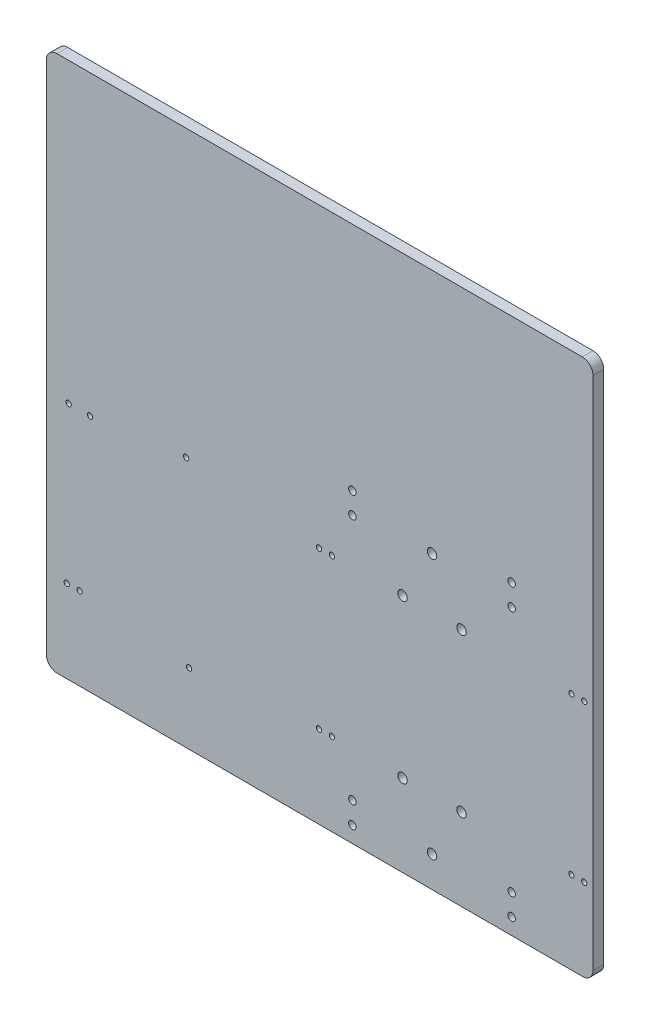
from build123d import *

# Parameters (mm, degrees)
SKETCH1_R           = 2.4765
SKETCH1_R_2         = 2.4892
SKETCH1_R_3         = 4.40055
SKETCH1_R_4         = 3.5
BOSS_EXTRUDE1_DEPTH = 10
FILLET1_R           = 10


with BuildPart() as part:
    # Sketch1 → Boss-Extrude1 (new body)
    with BuildSketch(Plane.XY):
        with BuildLine():
            ThreePointArc((41.275, 0), (48.010192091, 2.789807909), (50.8, 9.525))
            Line((50.8, 9.525), (50.8, 500))
            Line((50.8, 500), (-458.725, 500))
            Line((-458.725, 500), (-458.725, 0))
            Line((-458.725, 0), (41.275, 0))
        make_face()
        with Locations((42.7125, 76.999999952)):
            Circle(SKETCH1_R, mode=Mode.SUBTRACT)
        with Locations((42.7125, 223.000000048)):
            Circle(SKETCH1_R_2, mode=Mode.SUBTRACT)
        with Locations((-99.2, 271.25)):
            Circle(SKETCH1_R_3, mode=Mode.SUBTRACT)
        with Locations((-25.00000001, 265)):
            Circle(SKETCH1_R_4, mode=Mode.SUBTRACT)
        with Locations((-25.00000001, 285)):
            Circle(SKETCH1_R_4, mode=Mode.SUBTRACT)
        with Locations((-439.725, 76.999999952)):
            Circle(SKETCH1_R_2, mode=Mode.SUBTRACT)
        with Locations((-427.725, 76.999999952)):
            Circle(SKETCH1_R, mode=Mode.SUBTRACT)
        with Locations((-325.652282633, 65.799999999)):
            Circle(SKETCH1_R_2, mode=Mode.SUBTRACT)
        with Locations((-204.50625, 76.999999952)):
            Circle(SKETCH1_R_2, mode=Mode.SUBTRACT)
        with Locations((-437.930886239, 223.000000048)):
            Circle(SKETCH1_R_2, mode=Mode.SUBTRACT)
        with Locations((-417.930886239, 223.000000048)):
            Circle(SKETCH1_R_2, mode=Mode.SUBTRACT)
        with Locations((-328.426497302, 234.199999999)):
            Circle(SKETCH1_R_2, mode=Mode.SUBTRACT)
        with Locations((-204.50625, 223.000000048)):
            Circle(SKETCH1_R, mode=Mode.SUBTRACT)
        with Locations((-173.39999999, 15)):
            Circle(SKETCH1_R_4, mode=Mode.SUBTRACT)
        with Locations((-173.39999999, 35)):
            Circle(SKETCH1_R_4, mode=Mode.SUBTRACT)
        with Locations((-99.2, 28.75)):
            Circle(SKETCH1_R_3, mode=Mode.SUBTRACT)
        with Locations((-192.50625, 76.999999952)):
            Circle(SKETCH1_R, mode=Mode.SUBTRACT)
        with Locations((-126.69630657, 76.375)):
            Circle(SKETCH1_R_3, mode=Mode.SUBTRACT)
        with Locations((-25.00000001, 15)):
            Circle(SKETCH1_R_4, mode=Mode.SUBTRACT)
        with Locations((-25.00000001, 35)):
            Circle(SKETCH1_R_4, mode=Mode.SUBTRACT)
        with Locations((-71.70369343, 76.375)):
            Circle(SKETCH1_R_3, mode=Mode.SUBTRACT)
        with Locations((30.7125, 76.999999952)):
            Circle(SKETCH1_R_2, mode=Mode.SUBTRACT)
        with Locations((-192.50625, 223.000000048)):
            Circle(SKETCH1_R_2, mode=Mode.SUBTRACT)
        with Locations((-126.69630657, 223.625)):
            Circle(SKETCH1_R_3, mode=Mode.SUBTRACT)
        with Locations((-71.70369343, 223.625)):
            Circle(SKETCH1_R_3, mode=Mode.SUBTRACT)
        with Locations((30.7125, 223.000000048)):
            Circle(SKETCH1_R, mode=Mode.SUBTRACT)
        with Locations((-173.39999999, 265)):
            Circle(SKETCH1_R_4, mode=Mode.SUBTRACT)
        with Locations((-173.39999999, 285)):
            Circle(SKETCH1_R_4, mode=Mode.SUBTRACT)
    extrude(amount=BOSS_EXTRUDE1_DEPTH)

    # Fillet1
    fillet1_edges = [part.edges().sort_by_distance(p)[0] for p in [
        (-458.725, 0, 5),
        (-458.725, 500, 5),
        (50.8, 500, 5),
    ]]
    fillet(fillet1_edges, radius=FILLET1_R)


solid = part.part
